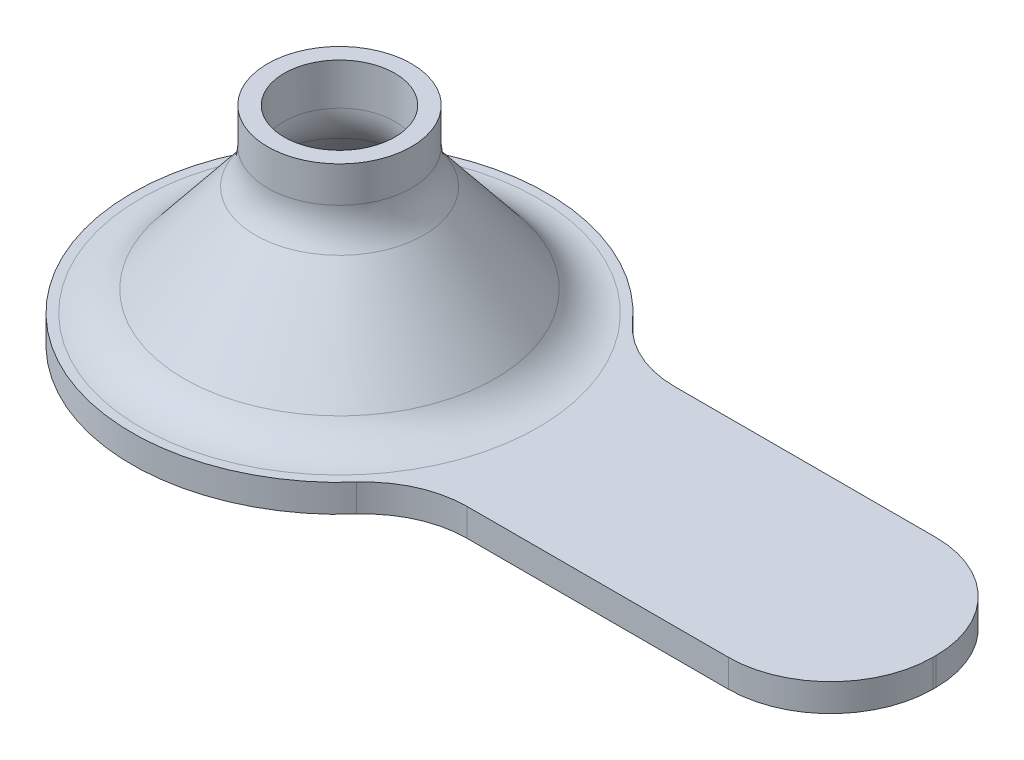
ISO-10303-21;
HEADER;
FILE_DESCRIPTION(('STEP AP214'),'2;1');
FILE_NAME('part.step','',(''),(''),'','','');
FILE_SCHEMA(('AUTOMOTIVE_DESIGN { 1 0 10303 214 1 1 1 1 }'));
ENDSEC;
DATA;
#1=APPLICATION_CONTEXT('core data for automotive mechanical design processes');
#2=APPLICATION_PROTOCOL_DEFINITION('international standard','automotive_design',2000,#1);
#3=PRODUCT_CONTEXT('',#1,'mechanical');
#4=PRODUCT('Part','Part','',(#3));
#5=PRODUCT_RELATED_PRODUCT_CATEGORY('part','',(#4));
#6=PRODUCT_DEFINITION_FORMATION('','',#4);
#7=PRODUCT_DEFINITION_CONTEXT('part definition',#1,'design');
#8=PRODUCT_DEFINITION('design','',#6,#7);
#9=PRODUCT_DEFINITION_SHAPE('','',#8);
#10=(LENGTH_UNIT() NAMED_UNIT(*) SI_UNIT(.MILLI.,.METRE.));
#11=(NAMED_UNIT(*) PLANE_ANGLE_UNIT() SI_UNIT($,.RADIAN.));
#12=(NAMED_UNIT(*) SI_UNIT($,.STERADIAN.) SOLID_ANGLE_UNIT());
#13=UNCERTAINTY_MEASURE_WITH_UNIT(LENGTH_MEASURE(1.E-05),#10,'distance_accuracy_value','');
#14=(GEOMETRIC_REPRESENTATION_CONTEXT(3) GLOBAL_UNCERTAINTY_ASSIGNED_CONTEXT((#13)) GLOBAL_UNIT_ASSIGNED_CONTEXT((#10,
#11,#12)) REPRESENTATION_CONTEXT('',''));
#15=CARTESIAN_POINT('',(0.,0.,0.));
#16=DIRECTION('',(0.,0.,1.));
#17=DIRECTION('',(1.,0.,0.));
#18=AXIS2_PLACEMENT_3D('',#15,#16,#17);
#19=CARTESIAN_POINT('',(0.,0.,0.));
#20=DIRECTION('',(0.,-1.,0.));
#21=DIRECTION('',(0.,0.,-1.));
#22=AXIS2_PLACEMENT_3D('',#19,#20,#21);
#23=CONICAL_SURFACE('',#22,8.91504526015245,0.676923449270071);
#24=CARTESIAN_POINT('',(0.,2.21894956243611,0.));
#25=DIRECTION('',(0.,1.,0.));
#26=DIRECTION('',(0.,0.,1.));
#27=AXIS2_PLACEMENT_3D('',#24,#25,#26);
#28=CIRCLE('',#27,7.13192939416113);
#29=CARTESIAN_POINT('',(0.,2.21894956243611,7.13192939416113));
#30=VERTEX_POINT('',#29);
#31=EDGE_CURVE('E127',#30,#30,#28,.T.);
#32=ORIENTED_EDGE('',*,*,#31,.T.);
#33=EDGE_LOOP('',(#32));
#34=FACE_BOUND('',#33,.T.);
#35=CARTESIAN_POINT('',(0.,6.28804749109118,0.));
#36=DIRECTION('',(0.,-1.,0.));
#37=DIRECTION('',(0.,0.,-1.));
#38=AXIS2_PLACEMENT_3D('',#35,#36,#37);
#39=CIRCLE('',#38,3.86206098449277);
#40=CARTESIAN_POINT('',(0.,6.28804749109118,-3.86206098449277));
#41=VERTEX_POINT('',#40);
#42=EDGE_CURVE('E198',#41,#41,#39,.T.);
#43=ORIENTED_EDGE('',*,*,#42,.T.);
#44=EDGE_LOOP('',(#43));
#45=FACE_BOUND('',#44,.T.);
#46=ADVANCED_FACE('F36',(#34,#45),#23,.T.);
#47=CARTESIAN_POINT('',(0.,6.71677062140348,0.));
#48=DIRECTION('',(0.,-1.,0.));
#49=DIRECTION('',(0.,0.,-1.));
#50=AXIS2_PLACEMENT_3D('',#47,#48,#49);
#51=CONICAL_SURFACE('',#50,2.54,0.676923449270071);
#52=CARTESIAN_POINT('',(0.,6.01981811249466,0.));
#53=DIRECTION('',(0.,1.,0.));
#54=DIRECTION('',(0.,0.,1.));
#55=AXIS2_PLACEMENT_3D('',#52,#53,#54);
#56=CIRCLE('',#55,3.10006098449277);
#57=CARTESIAN_POINT('',(0.,6.01981811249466,3.10006098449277));
#58=VERTEX_POINT('',#57);
#59=EDGE_CURVE('E195',#58,#58,#56,.T.);
#60=ORIENTED_EDGE('',*,*,#59,.T.);
#61=EDGE_LOOP('',(#60));
#62=FACE_BOUND('',#61,.T.);
#63=CARTESIAN_POINT('',(0.,0.395104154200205,0.));
#64=DIRECTION('',(0.,-1.,0.));
#65=DIRECTION('',(0.,0.,-1.));
#66=AXIS2_PLACEMENT_3D('',#63,#64,#65);
#67=CIRCLE('',#66,7.62);
#68=CARTESIAN_POINT('',(0.,0.395104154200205,-7.62));
#69=VERTEX_POINT('',#68);
#70=EDGE_CURVE('E175',#69,#69,#67,.T.);
#71=ORIENTED_EDGE('',*,*,#70,.T.);
#72=EDGE_LOOP('',(#71));
#73=FACE_BOUND('',#72,.T.);
#74=ADVANCED_FACE('F227',(#62,#73),#51,.F.);
#75=CARTESIAN_POINT('',(0.,0.,0.));
#76=DIRECTION('',(0.,-1.,0.));
#77=DIRECTION('',(0.,0.,-1.));
#78=AXIS2_PLACEMENT_3D('',#75,#76,#77);
#79=CYLINDRICAL_SURFACE('',#78,3.302);
#80=CARTESIAN_POINT('',(0.,7.87909792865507,0.));
#81=DIRECTION('',(0.,-1.,0.));
#82=DIRECTION('',(0.,0.,-1.));
#83=AXIS2_PLACEMENT_3D('',#80,#81,#82);
#84=CIRCLE('',#83,3.302);
#85=CARTESIAN_POINT('',(0.,7.87909792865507,-3.302));
#86=VERTEX_POINT('',#85);
#87=EDGE_CURVE('E201',#86,#86,#84,.F.);
#88=ORIENTED_EDGE('',*,*,#87,.T.);
#89=EDGE_LOOP('',(#88));
#90=FACE_BOUND('',#89,.T.);
#91=CARTESIAN_POINT('',(0.,9.525,0.));
#92=DIRECTION('',(0.,-1.,0.));
#93=DIRECTION('',(0.,0.,-1.));
#94=AXIS2_PLACEMENT_3D('',#91,#92,#93);
#95=CIRCLE('',#94,3.302);
#96=CARTESIAN_POINT('',(0.,9.525,-3.302));
#97=VERTEX_POINT('',#96);
#98=EDGE_CURVE('E189',#97,#97,#95,.T.);
#99=ORIENTED_EDGE('',*,*,#98,.T.);
#100=EDGE_LOOP('',(#99));
#101=FACE_BOUND('',#100,.T.);
#102=ADVANCED_FACE('F232',(#90,#101),#79,.T.);
#103=CARTESIAN_POINT('',(3.302,9.525,0.));
#104=DIRECTION('',(0.,1.,0.));
#105=DIRECTION('',(0.,0.,1.));
#106=AXIS2_PLACEMENT_3D('',#103,#104,#105);
#107=PLANE('',#106);
#108=CARTESIAN_POINT('',(0.,9.525,0.));
#109=DIRECTION('',(0.,-1.,0.));
#110=DIRECTION('',(0.,0.,-1.));
#111=AXIS2_PLACEMENT_3D('',#108,#109,#110);
#112=CIRCLE('',#111,2.54);
#113=CARTESIAN_POINT('',(0.,9.525,-2.54));
#114=VERTEX_POINT('',#113);
#115=EDGE_CURVE('E179',#114,#114,#112,.T.);
#116=ORIENTED_EDGE('',*,*,#115,.T.);
#117=EDGE_LOOP('',(#116));
#118=FACE_BOUND('',#117,.T.);
#119=ORIENTED_EDGE('',*,*,#98,.F.);
#120=EDGE_LOOP('',(#119));
#121=FACE_BOUND('',#120,.T.);
#122=ADVANCED_FACE('F257',(#118,#121),#107,.T.);
#123=CARTESIAN_POINT('',(0.,0.,0.));
#124=DIRECTION('',(0.,-1.,0.));
#125=DIRECTION('',(0.,0.,-1.));
#126=AXIS2_PLACEMENT_3D('',#123,#124,#125);
#127=CYLINDRICAL_SURFACE('',#126,2.54);
#128=CARTESIAN_POINT('',(0.,7.61086855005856,0.));
#129=DIRECTION('',(0.,1.,0.));
#130=DIRECTION('',(0.,0.,1.));
#131=AXIS2_PLACEMENT_3D('',#128,#129,#130);
#132=CIRCLE('',#131,2.54);
#133=CARTESIAN_POINT('',(0.,7.61086855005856,2.54));
#134=VERTEX_POINT('',#133);
#135=EDGE_CURVE('E192',#134,#134,#132,.F.);
#136=ORIENTED_EDGE('',*,*,#135,.T.);
#137=EDGE_LOOP('',(#136));
#138=FACE_BOUND('',#137,.T.);
#139=ORIENTED_EDGE('',*,*,#115,.F.);
#140=EDGE_LOOP('',(#139));
#141=FACE_BOUND('',#140,.T.);
#142=ADVANCED_FACE('F245',(#138,#141),#127,.F.);
#143=CARTESIAN_POINT('',(0.,7.61086855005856,0.));
#144=DIRECTION('',(0.,1.,0.));
#145=DIRECTION('',(0.,0.,1.));
#146=AXIS2_PLACEMENT_3D('',#143,#144,#145);
#147=TOROIDAL_SURFACE('',#146,5.08,2.54);
#148=ORIENTED_EDGE('',*,*,#59,.F.);
#149=EDGE_LOOP('',(#148));
#150=FACE_BOUND('',#149,.T.);
#151=ORIENTED_EDGE('',*,*,#135,.F.);
#152=EDGE_LOOP('',(#151));
#153=FACE_BOUND('',#152,.T.);
#154=ADVANCED_FACE('F242',(#150,#153),#147,.T.);
#155=CARTESIAN_POINT('',(0.,7.87909792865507,0.));
#156=DIRECTION('',(0.,-1.,0.));
#157=DIRECTION('',(0.,0.,-1.));
#158=AXIS2_PLACEMENT_3D('',#155,#156,#157);
#159=TOROIDAL_SURFACE('',#158,5.842,2.54);
#160=ORIENTED_EDGE('',*,*,#87,.F.);
#161=EDGE_LOOP('',(#160));
#162=FACE_BOUND('',#161,.T.);
#163=ORIENTED_EDGE('',*,*,#42,.F.);
#164=EDGE_LOOP('',(#163));
#165=FACE_BOUND('',#164,.T.);
#166=ADVANCED_FACE('F240',(#162,#165),#159,.F.);
#167=CARTESIAN_POINT('',(7.9375,0.,0.));
#168=DIRECTION('',(0.,-1.,0.));
#169=DIRECTION('',(0.,0.,-1.));
#170=AXIS2_PLACEMENT_3D('',#167,#168,#169);
#171=PLANE('',#170);
#172=CARTESIAN_POINT('',(0.,0.,0.));
#173=DIRECTION('',(0.,-1.,0.));
#174=DIRECTION('',(0.,0.,-1.));
#175=AXIS2_PLACEMENT_3D('',#172,#173,#174);
#176=CIRCLE('',#175,8.98052262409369);
#177=CARTESIAN_POINT('',(0.,0.,-8.98052262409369));
#178=VERTEX_POINT('',#177);
#179=EDGE_CURVE('E203',#178,#178,#176,.F.);
#180=ORIENTED_EDGE('',*,*,#179,.T.);
#181=EDGE_LOOP('',(#180));
#182=FACE_BOUND('',#181,.T.);
#183=DIRECTION('',(0.,0.,1.));
#184=VECTOR('',#183,1.);
#185=CARTESIAN_POINT('',(27.2988919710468,0.,4.7625));
#186=LINE('',#185,#184);
#187=CARTESIAN_POINT('',(27.2988919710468,0.,-0.0634999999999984));
#188=VERTEX_POINT('',#187);
#189=CARTESIAN_POINT('',(27.2988919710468,0.,0.0635000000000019));
#190=VERTEX_POINT('',#189);
#191=EDGE_CURVE('E105',#188,#190,#186,.T.);
#192=ORIENTED_EDGE('',*,*,#191,.T.);
#193=CARTESIAN_POINT('',(22.5998919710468,0.,0.0635000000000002));
#194=DIRECTION('',(0.,-1.,0.));
#195=DIRECTION('',(0.,0.,-1.));
#196=AXIS2_PLACEMENT_3D('',#193,#194,#195);
#197=CIRCLE('',#196,4.699);
#198=CARTESIAN_POINT('',(22.5998919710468,0.,4.7625));
#199=VERTEX_POINT('',#198);
#200=EDGE_CURVE('E111',#190,#199,#197,.T.);
#201=ORIENTED_EDGE('',*,*,#200,.T.);
#202=DIRECTION('',(-1.,0.,0.));
#203=VECTOR('',#202,1.);
#204=CARTESIAN_POINT('',(8.24889197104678,0.,4.7625));
#205=LINE('',#204,#203);
#206=CARTESIAN_POINT('',(10.6208377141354,0.,4.7625));
#207=VERTEX_POINT('',#206);
#208=EDGE_CURVE('E120',#199,#207,#205,.T.);
#209=ORIENTED_EDGE('',*,*,#208,.T.);
#210=CARTESIAN_POINT('',(10.6208377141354,0.,9.4615));
#211=DIRECTION('',(0.,-1.,0.));
#212=DIRECTION('',(0.,0.,-1.));
#213=AXIS2_PLACEMENT_3D('',#210,#211,#212);
#214=CIRCLE('',#213,4.699);
#215=CARTESIAN_POINT('',(7.11216811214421,0.,6.33582589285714));
#216=VERTEX_POINT('',#215);
#217=EDGE_CURVE('E44',#207,#216,#214,.F.);
#218=ORIENTED_EDGE('',*,*,#217,.T.);
#219=CARTESIAN_POINT('',(0.,0.,0.));
#220=DIRECTION('',(0.,-1.,0.));
#221=DIRECTION('',(0.,0.,-1.));
#222=AXIS2_PLACEMENT_3D('',#219,#220,#221);
#223=CIRCLE('',#222,9.525);
#224=CARTESIAN_POINT('',(7.11216811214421,0.,-6.33582589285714));
#225=VERTEX_POINT('',#224);
#226=EDGE_CURVE('E154',#216,#225,#223,.T.);
#227=ORIENTED_EDGE('',*,*,#226,.T.);
#228=CARTESIAN_POINT('',(10.6208377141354,0.,-9.4615));
#229=DIRECTION('',(0.,-1.,0.));
#230=DIRECTION('',(0.,0.,-1.));
#231=AXIS2_PLACEMENT_3D('',#228,#229,#230);
#232=CIRCLE('',#231,4.699);
#233=CARTESIAN_POINT('',(10.6208377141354,0.,-4.7625));
#234=VERTEX_POINT('',#233);
#235=EDGE_CURVE('E148',#225,#234,#232,.F.);
#236=ORIENTED_EDGE('',*,*,#235,.T.);
#237=DIRECTION('',(1.,0.,0.));
#238=VECTOR('',#237,1.);
#239=CARTESIAN_POINT('',(8.24889197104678,0.,-4.7625));
#240=LINE('',#239,#238);
#241=CARTESIAN_POINT('',(22.5998919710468,0.,-4.7625));
#242=VERTEX_POINT('',#241);
#243=EDGE_CURVE('E106',#234,#242,#240,.T.);
#244=ORIENTED_EDGE('',*,*,#243,.T.);
#245=CARTESIAN_POINT('',(22.5998919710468,0.,-0.0635000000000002));
#246=DIRECTION('',(0.,-1.,0.));
#247=DIRECTION('',(0.,0.,-1.));
#248=AXIS2_PLACEMENT_3D('',#245,#246,#247);
#249=CIRCLE('',#248,4.699);
#250=EDGE_CURVE('E102',#242,#188,#249,.T.);
#251=ORIENTED_EDGE('',*,*,#250,.T.);
#252=EDGE_LOOP('',(#192,#201,#209,#218,#227,#236,#244,#251));
#253=FACE_BOUND('',#252,.T.);
#254=ADVANCED_FACE('F104',(#182,#253),#171,.T.);
#255=CARTESIAN_POINT('',(0.,1.27,0.));
#256=DIRECTION('',(0.,-1.,0.));
#257=DIRECTION('',(0.,0.,-1.));
#258=AXIS2_PLACEMENT_3D('',#255,#256,#257);
#259=CYLINDRICAL_SURFACE('',#258,9.525);
#260=CARTESIAN_POINT('',(0.,1.27,0.));
#261=DIRECTION('',(0.,-1.,0.));
#262=DIRECTION('',(0.,0.,-1.));
#263=AXIS2_PLACEMENT_3D('',#260,#261,#262);
#264=CIRCLE('',#263,9.525);
#265=CARTESIAN_POINT('',(7.11216811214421,1.27,6.33582589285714));
#266=VERTEX_POINT('',#265);
#267=CARTESIAN_POINT('',(7.11216811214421,1.27,-6.33582589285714));
#268=VERTEX_POINT('',#267);
#269=EDGE_CURVE('E171',#266,#268,#264,.T.);
#270=ORIENTED_EDGE('',*,*,#269,.T.);
#271=DIRECTION('',(0.,-1.,0.));
#272=VECTOR('',#271,1.);
#273=CARTESIAN_POINT('',(7.11216811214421,1.27,-6.33582589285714));
#274=LINE('',#273,#272);
#275=EDGE_CURVE('E145',#268,#225,#274,.T.);
#276=ORIENTED_EDGE('',*,*,#275,.T.);
#277=ORIENTED_EDGE('',*,*,#226,.F.);
#278=DIRECTION('',(0.,-1.,0.));
#279=VECTOR('',#278,1.);
#280=CARTESIAN_POINT('',(7.11216811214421,1.27,6.33582589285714));
#281=LINE('',#280,#279);
#282=EDGE_CURVE('E143',#216,#266,#281,.F.);
#283=ORIENTED_EDGE('',*,*,#282,.T.);
#284=EDGE_LOOP('',(#270,#276,#277,#283));
#285=FACE_BOUND('',#284,.T.);
#286=ADVANCED_FACE('F161',(#285),#259,.T.);
#287=CARTESIAN_POINT('',(8.24889197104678,1.27,4.7625));
#288=DIRECTION('',(0.,0.,1.));
#289=DIRECTION('',(1.,0.,0.));
#290=AXIS2_PLACEMENT_3D('',#287,#288,#289);
#291=PLANE('',#290);
#292=ORIENTED_EDGE('',*,*,#208,.F.);
#293=DIRECTION('',(0.,-1.,0.));
#294=VECTOR('',#293,1.);
#295=CARTESIAN_POINT('',(22.5998919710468,1.27,4.7625));
#296=LINE('',#295,#294);
#297=CARTESIAN_POINT('',(22.5998919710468,1.27,4.7625));
#298=VERTEX_POINT('',#297);
#299=EDGE_CURVE('E135',#199,#298,#296,.F.);
#300=ORIENTED_EDGE('',*,*,#299,.T.);
#301=DIRECTION('',(-1.,0.,0.));
#302=VECTOR('',#301,1.);
#303=CARTESIAN_POINT('',(8.24889197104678,1.27,4.7625));
#304=LINE('',#303,#302);
#305=CARTESIAN_POINT('',(10.6208377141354,1.27,4.7625));
#306=VERTEX_POINT('',#305);
#307=EDGE_CURVE('E169',#298,#306,#304,.T.);
#308=ORIENTED_EDGE('',*,*,#307,.T.);
#309=DIRECTION('',(0.,1.,0.));
#310=VECTOR('',#309,1.);
#311=CARTESIAN_POINT('',(10.6208377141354,0.,4.7625));
#312=LINE('',#311,#310);
#313=EDGE_CURVE('E132',#306,#207,#312,.F.);
#314=ORIENTED_EDGE('',*,*,#313,.T.);
#315=EDGE_LOOP('',(#292,#300,#308,#314));
#316=FACE_BOUND('',#315,.T.);
#317=ADVANCED_FACE('F173',(#316),#291,.T.);
#318=CARTESIAN_POINT('',(27.2988919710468,1.27,4.7625));
#319=DIRECTION('',(1.,0.,0.));
#320=DIRECTION('',(0.,0.,-1.));
#321=AXIS2_PLACEMENT_3D('',#318,#319,#320);
#322=PLANE('',#321);
#323=DIRECTION('',(0.,0.,1.));
#324=VECTOR('',#323,1.);
#325=CARTESIAN_POINT('',(27.2988919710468,1.27,4.7625));
#326=LINE('',#325,#324);
#327=CARTESIAN_POINT('',(27.2988919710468,1.27,-0.0634999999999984));
#328=VERTEX_POINT('',#327);
#329=CARTESIAN_POINT('',(27.2988919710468,1.27,0.0635000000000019));
#330=VERTEX_POINT('',#329);
#331=EDGE_CURVE('E176',#328,#330,#326,.T.);
#332=ORIENTED_EDGE('',*,*,#331,.T.);
#333=DIRECTION('',(0.,-1.,0.));
#334=VECTOR('',#333,1.);
#335=CARTESIAN_POINT('',(27.2988919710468,1.27,0.0635000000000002));
#336=LINE('',#335,#334);
#337=EDGE_CURVE('E112',#330,#190,#336,.T.);
#338=ORIENTED_EDGE('',*,*,#337,.T.);
#339=ORIENTED_EDGE('',*,*,#191,.F.);
#340=DIRECTION('',(0.,-1.,0.));
#341=VECTOR('',#340,1.);
#342=CARTESIAN_POINT('',(27.2988919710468,1.27,-0.0635000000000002));
#343=LINE('',#342,#341);
#344=EDGE_CURVE('E118',#188,#328,#343,.F.);
#345=ORIENTED_EDGE('',*,*,#344,.T.);
#346=EDGE_LOOP('',(#332,#338,#339,#345));
#347=FACE_BOUND('',#346,.T.);
#348=ADVANCED_FACE('F117',(#347),#322,.T.);
#349=CARTESIAN_POINT('',(8.24889197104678,1.27,-4.7625));
#350=DIRECTION('',(0.,0.,-1.));
#351=DIRECTION('',(-1.,0.,0.));
#352=AXIS2_PLACEMENT_3D('',#349,#350,#351);
#353=PLANE('',#352);
#354=DIRECTION('',(1.,0.,0.));
#355=VECTOR('',#354,1.);
#356=CARTESIAN_POINT('',(8.24889197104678,1.27,-4.7625));
#357=LINE('',#356,#355);
#358=CARTESIAN_POINT('',(10.6208377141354,1.27,-4.7625));
#359=VERTEX_POINT('',#358);
#360=CARTESIAN_POINT('',(22.5998919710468,1.27,-4.7625));
#361=VERTEX_POINT('',#360);
#362=EDGE_CURVE('E181',#359,#361,#357,.T.);
#363=ORIENTED_EDGE('',*,*,#362,.T.);
#364=DIRECTION('',(0.,-1.,0.));
#365=VECTOR('',#364,1.);
#366=CARTESIAN_POINT('',(22.5998919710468,1.27,-4.7625));
#367=LINE('',#366,#365);
#368=EDGE_CURVE('E141',#361,#242,#367,.T.);
#369=ORIENTED_EDGE('',*,*,#368,.T.);
#370=ORIENTED_EDGE('',*,*,#243,.F.);
#371=DIRECTION('',(0.,1.,0.));
#372=VECTOR('',#371,1.);
#373=CARTESIAN_POINT('',(10.6208377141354,1.27,-4.7625));
#374=LINE('',#373,#372);
#375=EDGE_CURVE('E58',#234,#359,#374,.T.);
#376=ORIENTED_EDGE('',*,*,#375,.T.);
#377=EDGE_LOOP('',(#363,#369,#370,#376));
#378=FACE_BOUND('',#377,.T.);
#379=ADVANCED_FACE('F270',(#378),#353,.T.);
#380=CARTESIAN_POINT('',(0.,1.27,0.));
#381=DIRECTION('',(0.,-1.,0.));
#382=DIRECTION('',(0.,0.,-1.));
#383=AXIS2_PLACEMENT_3D('',#380,#381,#382);
#384=PLANE('',#383);
#385=CARTESIAN_POINT('',(0.,1.27,0.));
#386=DIRECTION('',(0.,-1.,0.));
#387=DIRECTION('',(0.,0.,-1.));
#388=AXIS2_PLACEMENT_3D('',#385,#386,#387);
#389=CIRCLE('',#388,9.11186840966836);
#390=CARTESIAN_POINT('',(0.,1.27,-9.11186840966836));
#391=VERTEX_POINT('',#390);
#392=EDGE_CURVE('E123',#391,#391,#389,.T.);
#393=ORIENTED_EDGE('',*,*,#392,.T.);
#394=EDGE_LOOP('',(#393));
#395=FACE_BOUND('',#394,.T.);
#396=ORIENTED_EDGE('',*,*,#307,.F.);
#397=CARTESIAN_POINT('',(22.5998919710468,1.27,0.0635000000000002));
#398=DIRECTION('',(0.,-1.,0.));
#399=DIRECTION('',(0.,0.,-1.));
#400=AXIS2_PLACEMENT_3D('',#397,#398,#399);
#401=CIRCLE('',#400,4.699);
#402=EDGE_CURVE('E138',#298,#330,#401,.F.);
#403=ORIENTED_EDGE('',*,*,#402,.T.);
#404=ORIENTED_EDGE('',*,*,#331,.F.);
#405=CARTESIAN_POINT('',(22.5998919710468,1.27,-0.0635000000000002));
#406=DIRECTION('',(0.,-1.,0.));
#407=DIRECTION('',(0.,0.,-1.));
#408=AXIS2_PLACEMENT_3D('',#405,#406,#407);
#409=CIRCLE('',#408,4.699);
#410=EDGE_CURVE('E51',#328,#361,#409,.F.);
#411=ORIENTED_EDGE('',*,*,#410,.T.);
#412=ORIENTED_EDGE('',*,*,#362,.F.);
#413=CARTESIAN_POINT('',(10.6208377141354,1.27,-9.4615));
#414=DIRECTION('',(0.,-1.,0.));
#415=DIRECTION('',(0.,0.,-1.));
#416=AXIS2_PLACEMENT_3D('',#413,#414,#415);
#417=CIRCLE('',#416,4.699);
#418=EDGE_CURVE('E150',#359,#268,#417,.T.);
#419=ORIENTED_EDGE('',*,*,#418,.T.);
#420=ORIENTED_EDGE('',*,*,#269,.F.);
#421=CARTESIAN_POINT('',(10.6208377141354,1.27,9.4615));
#422=DIRECTION('',(0.,-1.,0.));
#423=DIRECTION('',(0.,0.,-1.));
#424=AXIS2_PLACEMENT_3D('',#421,#422,#423);
#425=CIRCLE('',#424,4.699);
#426=EDGE_CURVE('E11',#266,#306,#425,.T.);
#427=ORIENTED_EDGE('',*,*,#426,.T.);
#428=EDGE_LOOP('',(#396,#403,#404,#411,#412,#419,#420,#427));
#429=FACE_BOUND('',#428,.T.);
#430=ADVANCED_FACE('F168',(#395,#429),#384,.F.);
#431=CARTESIAN_POINT('',(0.,2.54,0.));
#432=DIRECTION('',(0.,-1.,0.));
#433=DIRECTION('',(0.,0.,-1.));
#434=AXIS2_PLACEMENT_3D('',#431,#432,#433);
#435=TOROIDAL_SURFACE('',#434,8.98052262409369,2.54);
#436=ORIENTED_EDGE('',*,*,#179,.F.);
#437=EDGE_LOOP('',(#436));
#438=FACE_BOUND('',#437,.T.);
#439=ORIENTED_EDGE('',*,*,#70,.F.);
#440=EDGE_LOOP('',(#439));
#441=FACE_BOUND('',#440,.T.);
#442=ADVANCED_FACE('F214',(#438,#441),#435,.T.);
#443=CARTESIAN_POINT('',(0.,3.81,0.));
#444=DIRECTION('',(0.,-1.,0.));
#445=DIRECTION('',(0.,0.,-1.));
#446=AXIS2_PLACEMENT_3D('',#443,#444,#445);
#447=TOROIDAL_SURFACE('',#446,9.11186840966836,2.54);
#448=ORIENTED_EDGE('',*,*,#392,.F.);
#449=EDGE_LOOP('',(#448));
#450=FACE_BOUND('',#449,.T.);
#451=ORIENTED_EDGE('',*,*,#31,.F.);
#452=EDGE_LOOP('',(#451));
#453=FACE_BOUND('',#452,.T.);
#454=ADVANCED_FACE('F211',(#450,#453),#447,.F.);
#455=CARTESIAN_POINT('',(22.5998919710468,1.27,0.0635000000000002));
#456=DIRECTION('',(0.,-1.,0.));
#457=DIRECTION('',(0.,0.,-1.));
#458=AXIS2_PLACEMENT_3D('',#455,#456,#457);
#459=CYLINDRICAL_SURFACE('',#458,4.699);
#460=ORIENTED_EDGE('',*,*,#402,.F.);
#461=ORIENTED_EDGE('',*,*,#299,.F.);
#462=ORIENTED_EDGE('',*,*,#200,.F.);
#463=ORIENTED_EDGE('',*,*,#337,.F.);
#464=EDGE_LOOP('',(#460,#461,#462,#463));
#465=FACE_BOUND('',#464,.T.);
#466=ADVANCED_FACE('F213',(#465),#459,.T.);
#467=CARTESIAN_POINT('',(22.5998919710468,1.27,-0.0635000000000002));
#468=DIRECTION('',(0.,-1.,0.));
#469=DIRECTION('',(0.,0.,-1.));
#470=AXIS2_PLACEMENT_3D('',#467,#468,#469);
#471=CYLINDRICAL_SURFACE('',#470,4.699);
#472=ORIENTED_EDGE('',*,*,#410,.F.);
#473=ORIENTED_EDGE('',*,*,#344,.F.);
#474=ORIENTED_EDGE('',*,*,#250,.F.);
#475=ORIENTED_EDGE('',*,*,#368,.F.);
#476=EDGE_LOOP('',(#472,#473,#474,#475));
#477=FACE_BOUND('',#476,.T.);
#478=ADVANCED_FACE('F122',(#477),#471,.T.);
#479=CARTESIAN_POINT('',(10.6208377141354,1.27,-9.4615));
#480=DIRECTION('',(0.,-1.,0.));
#481=DIRECTION('',(0.,0.,-1.));
#482=AXIS2_PLACEMENT_3D('',#479,#480,#481);
#483=CYLINDRICAL_SURFACE('',#482,4.699);
#484=ORIENTED_EDGE('',*,*,#418,.F.);
#485=ORIENTED_EDGE('',*,*,#375,.F.);
#486=ORIENTED_EDGE('',*,*,#235,.F.);
#487=ORIENTED_EDGE('',*,*,#275,.F.);
#488=EDGE_LOOP('',(#484,#485,#486,#487));
#489=FACE_BOUND('',#488,.T.);
#490=ADVANCED_FACE('F375',(#489),#483,.F.);
#491=CARTESIAN_POINT('',(10.6208377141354,1.27,9.4615));
#492=DIRECTION('',(0.,-1.,0.));
#493=DIRECTION('',(0.,0.,-1.));
#494=AXIS2_PLACEMENT_3D('',#491,#492,#493);
#495=CYLINDRICAL_SURFACE('',#494,4.699);
#496=ORIENTED_EDGE('',*,*,#426,.F.);
#497=ORIENTED_EDGE('',*,*,#282,.F.);
#498=ORIENTED_EDGE('',*,*,#217,.F.);
#499=ORIENTED_EDGE('',*,*,#313,.F.);
#500=EDGE_LOOP('',(#496,#497,#498,#499));
#501=FACE_BOUND('',#500,.T.);
#502=ADVANCED_FACE('F38',(#501),#495,.F.);
#503=CLOSED_SHELL('',(#46,#74,#102,#122,#142,#154,#166,#254,#286,#317,#348,#379,#430,#442,#454,
#466,#478,#490,#502));
#504=MANIFOLD_SOLID_BREP('B2',#503);
#505=ADVANCED_BREP_SHAPE_REPRESENTATION('',(#18,#504),#14);
#506=SHAPE_DEFINITION_REPRESENTATION(#9,#505);
ENDSEC;
END-ISO-10303-21;
